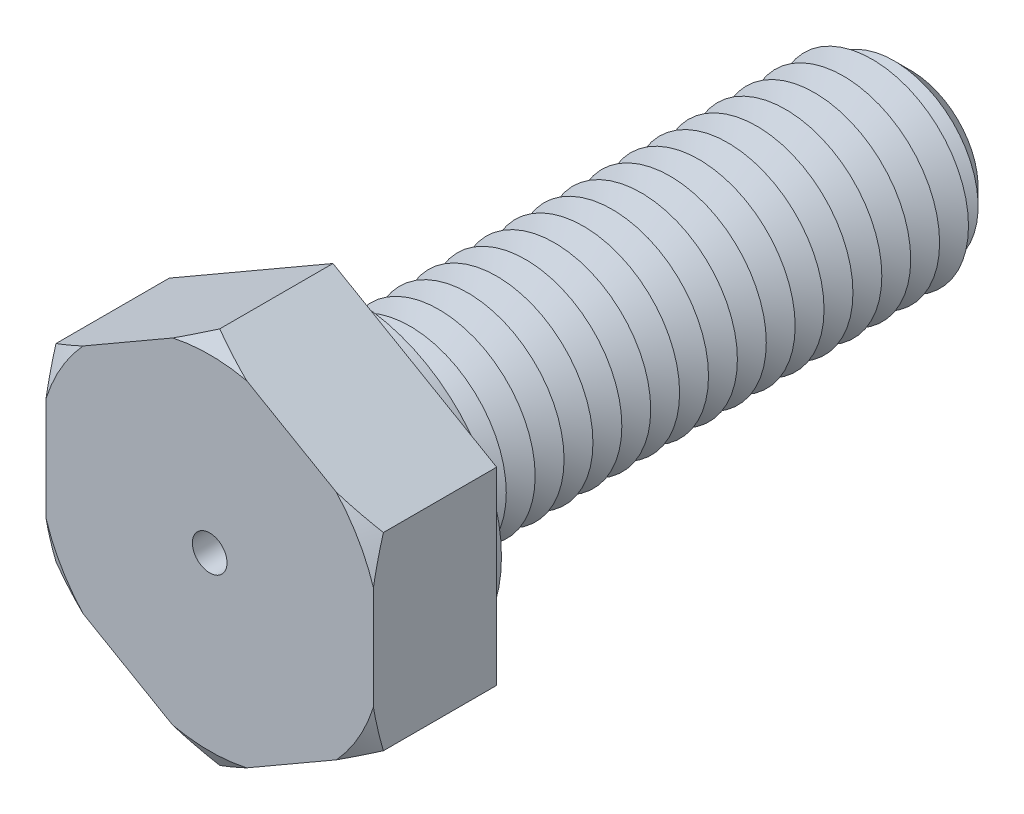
from build123d import *

# Parameters (mm, degrees)
BOSS_EXTRUDE1_DEPTH = 6.4
SKETCH3_R           = 5
BOSS_EXTRUDE2_DEPTH = 30
SKETCH4_R           = 7.75
BOSS_EXTRUDE3_DEPTH = 1
CHAMFER1_SIZE       = 1.5
LPATTERN1_COUNT     = 19
LPATTERN1_PITCH     = 1.5
SKETCH8_R           = 0.9
CUT_EXTRUDE1_DEPTH  = 36.4


with BuildPart() as part:
    # Sketch2 → Boss-Extrude1 (new body)
    with BuildSketch(Plane.XY):
        Polygon((0, 9.814954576), (-8.5, 4.907477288), (-8.5, -4.907477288), (0, -9.814954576), (8.5, -4.907477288), (8.5, 4.907477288), align=None)
    extrude(amount=BOSS_EXTRUDE1_DEPTH)

    # Sketch3 → Boss-Extrude2 (add)
    with BuildSketch(Plane(origin=(0, 0, 0), x_dir=(-1, 0, 0), z_dir=(0, 0, -1))):
        Circle(SKETCH3_R)
    extrude(amount=BOSS_EXTRUDE2_DEPTH)

    # Sketch4 → Boss-Extrude3 (add)
    with BuildSketch(Plane(origin=(0, 0, 0), x_dir=(-1, 0, 0), z_dir=(0, 0, -1))):
        with Locations(Location((0, 0, 0), (0, 0, 180))):
            Circle(SKETCH4_R)
    extrude(amount=BOSS_EXTRUDE3_DEPTH)

    # Chamfer1
    chamfer1_edges = [part.edges().sort_by_distance(p)[0] for p in [
        (5, 0, -30),
    ]]
    chamfer(chamfer1_edges, length=CHAMFER1_SIZE)

    # Sketch6 → Cut-Revolve1 (revolve, cut)
    with BuildSketch(Plane(origin=(0, 0, 0), x_dir=(0, 0, -1), z_dir=(1, 0, 0)), mode=Mode.PRIVATE) as cut_revolve1_sk:
        Polygon((1, 5), (1.75, 3.700961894), (2.5, 5), align=None)
    cut_revolve1 = revolve(cut_revolve1_sk.sketch.rotate(Axis((0, 0, 3.211670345), (0, 0, -1)), 90), axis=Axis((0, 0, 3.211670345), (0, 0, -1)), mode=Mode.SUBTRACT)

    # LPattern1: Cut-Revolve1 ×19
    with Locations(*[(0, 0, -i * LPATTERN1_PITCH) for i in range(1, LPATTERN1_COUNT)]):
        add(cut_revolve1, mode=Mode.SUBTRACT)

    # Sketch7 → Cut-Revolve2 (revolve, cut)
    with BuildSketch(Plane(origin=(0, 0, 0), x_dir=(0, 0, -1), z_dir=(1, 0, 0)), mode=Mode.PRIVATE) as cut_revolve2_sk:
        Polygon((-6.4, 9.814954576), (-6.4, 8.914954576), (-5.880384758, 9.814954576), align=None)
    revolve(cut_revolve2_sk.sketch.rotate(Axis((0, 0, 3.211670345), (0, 0, -1)), 270), axis=Axis((0, 0, 3.211670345), (0, 0, -1)), mode=Mode.SUBTRACT)

    # Sketch8 → Cut-Extrude1 (cut)
    with BuildSketch(Plane.XY.offset(6.4)):
        Circle(SKETCH8_R)
    extrude(amount=-CUT_EXTRUDE1_DEPTH, mode=Mode.SUBTRACT)


solid = part.part
